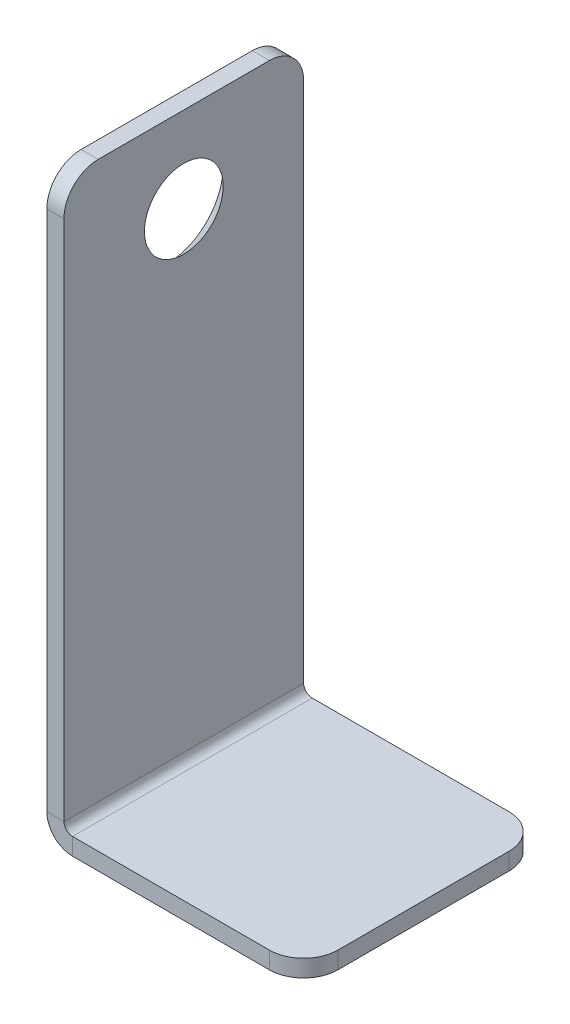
ISO-10303-21;
HEADER;
FILE_DESCRIPTION(('STEP AP214'),'2;1');
FILE_NAME('part.step','',(''),(''),'','','');
FILE_SCHEMA(('AUTOMOTIVE_DESIGN { 1 0 10303 214 1 1 1 1 }'));
ENDSEC;
DATA;
#1=APPLICATION_CONTEXT('core data for automotive mechanical design processes');
#2=APPLICATION_PROTOCOL_DEFINITION('international standard','automotive_design',2000,#1);
#3=PRODUCT_CONTEXT('',#1,'mechanical');
#4=PRODUCT('Part','Part','',(#3));
#5=PRODUCT_RELATED_PRODUCT_CATEGORY('part','',(#4));
#6=PRODUCT_DEFINITION_FORMATION('','',#4);
#7=PRODUCT_DEFINITION_CONTEXT('part definition',#1,'design');
#8=PRODUCT_DEFINITION('design','',#6,#7);
#9=PRODUCT_DEFINITION_SHAPE('','',#8);
#10=(LENGTH_UNIT() NAMED_UNIT(*) SI_UNIT(.MILLI.,.METRE.));
#11=(NAMED_UNIT(*) PLANE_ANGLE_UNIT() SI_UNIT($,.RADIAN.));
#12=(NAMED_UNIT(*) SI_UNIT($,.STERADIAN.) SOLID_ANGLE_UNIT());
#13=UNCERTAINTY_MEASURE_WITH_UNIT(LENGTH_MEASURE(1.E-05),#10,'distance_accuracy_value','');
#14=(GEOMETRIC_REPRESENTATION_CONTEXT(3) GLOBAL_UNCERTAINTY_ASSIGNED_CONTEXT((#13)) GLOBAL_UNIT_ASSIGNED_CONTEXT((#10,
#11,#12)) REPRESENTATION_CONTEXT('',''));
#15=CARTESIAN_POINT('',(0.,0.,0.));
#16=DIRECTION('',(0.,0.,1.));
#17=DIRECTION('',(1.,0.,0.));
#18=AXIS2_PLACEMENT_3D('',#15,#16,#17);
#19=CARTESIAN_POINT('',(0.,1.5,7.));
#20=DIRECTION('',(0.,0.,1.));
#21=DIRECTION('',(1.,0.,0.));
#22=AXIS2_PLACEMENT_3D('',#19,#20,#21);
#23=PLANE('',#22);
#24=DIRECTION('',(1.,0.,0.));
#25=VECTOR('',#24,1.);
#26=CARTESIAN_POINT('',(0.,1.5,7.));
#27=LINE('',#26,#25);
#28=CARTESIAN_POINT('',(0.,1.5,7.));
#29=VERTEX_POINT('',#28);
#30=CARTESIAN_POINT('',(1.,1.5,7.));
#31=VERTEX_POINT('',#30);
#32=EDGE_CURVE('E137',#29,#31,#27,.T.);
#33=ORIENTED_EDGE('',*,*,#32,.F.);
#34=CARTESIAN_POINT('',(1.5,1.5,7.));
#35=DIRECTION('',(0.,0.,-1.));
#36=DIRECTION('',(-1.,0.,0.));
#37=AXIS2_PLACEMENT_3D('',#34,#35,#36);
#38=CIRCLE('',#37,1.5);
#39=CARTESIAN_POINT('',(1.5,0.,7.));
#40=VERTEX_POINT('',#39);
#41=EDGE_CURVE('E135',#29,#40,#38,.F.);
#42=ORIENTED_EDGE('',*,*,#41,.T.);
#43=DIRECTION('',(0.,-1.,0.));
#44=VECTOR('',#43,1.);
#45=CARTESIAN_POINT('',(1.5,1.,7.));
#46=LINE('',#45,#44);
#47=CARTESIAN_POINT('',(1.5,1.,7.));
#48=VERTEX_POINT('',#47);
#49=EDGE_CURVE('E129',#48,#40,#46,.T.);
#50=ORIENTED_EDGE('',*,*,#49,.F.);
#51=CARTESIAN_POINT('',(1.5,1.5,7.));
#52=DIRECTION('',(0.,0.,1.));
#53=DIRECTION('',(1.,0.,0.));
#54=AXIS2_PLACEMENT_3D('',#51,#52,#53);
#55=CIRCLE('',#54,0.5);
#56=EDGE_CURVE('E133',#31,#48,#55,.T.);
#57=ORIENTED_EDGE('',*,*,#56,.F.);
#58=EDGE_LOOP('',(#33,#42,#50,#57));
#59=FACE_BOUND('',#58,.T.);
#60=ADVANCED_FACE('F36',(#59),#23,.T.);
#61=CARTESIAN_POINT('',(1.5,1.,7.));
#62=DIRECTION('',(0.,0.,1.));
#63=DIRECTION('',(1.,0.,0.));
#64=AXIS2_PLACEMENT_3D('',#61,#62,#63);
#65=PLANE('',#64);
#66=DIRECTION('',(0.,-1.,0.));
#67=VECTOR('',#66,1.);
#68=CARTESIAN_POINT('',(1.,34.,7.));
#69=LINE('',#68,#67);
#70=CARTESIAN_POINT('',(1.,32.,7.));
#71=VERTEX_POINT('',#70);
#72=EDGE_CURVE('E158',#71,#31,#69,.T.);
#73=ORIENTED_EDGE('',*,*,#72,.F.);
#74=DIRECTION('',(1.,0.,0.));
#75=VECTOR('',#74,1.);
#76=CARTESIAN_POINT('',(1.5,32.,7.));
#77=LINE('',#76,#75);
#78=CARTESIAN_POINT('',(0.,32.,7.));
#79=VERTEX_POINT('',#78);
#80=EDGE_CURVE('E212',#71,#79,#77,.F.);
#81=ORIENTED_EDGE('',*,*,#80,.T.);
#82=DIRECTION('',(0.,-1.,0.));
#83=VECTOR('',#82,1.);
#84=CARTESIAN_POINT('',(0.,34.,7.));
#85=LINE('',#84,#83);
#86=EDGE_CURVE('E160',#79,#29,#85,.T.);
#87=ORIENTED_EDGE('',*,*,#86,.T.);
#88=ORIENTED_EDGE('',*,*,#32,.T.);
#89=EDGE_LOOP('',(#73,#81,#87,#88));
#90=FACE_BOUND('',#89,.T.);
#91=ADVANCED_FACE('F295',(#90),#65,.T.);
#92=CARTESIAN_POINT('',(1.5,0.,-7.));
#93=DIRECTION('',(0.,0.,-1.));
#94=DIRECTION('',(-1.,0.,0.));
#95=AXIS2_PLACEMENT_3D('',#92,#93,#94);
#96=PLANE('',#95);
#97=DIRECTION('',(0.,1.,0.));
#98=VECTOR('',#97,1.);
#99=CARTESIAN_POINT('',(1.5,0.,-7.));
#100=LINE('',#99,#98);
#101=CARTESIAN_POINT('',(1.5,0.,-7.));
#102=VERTEX_POINT('',#101);
#103=CARTESIAN_POINT('',(1.5,1.,-7.));
#104=VERTEX_POINT('',#103);
#105=EDGE_CURVE('E138',#102,#104,#100,.T.);
#106=ORIENTED_EDGE('',*,*,#105,.F.);
#107=CARTESIAN_POINT('',(1.5,1.5,-7.));
#108=DIRECTION('',(0.,0.,-1.));
#109=DIRECTION('',(-1.,0.,0.));
#110=AXIS2_PLACEMENT_3D('',#107,#108,#109);
#111=CIRCLE('',#110,1.5);
#112=CARTESIAN_POINT('',(0.,1.5,-7.));
#113=VERTEX_POINT('',#112);
#114=EDGE_CURVE('E178',#113,#102,#111,.F.);
#115=ORIENTED_EDGE('',*,*,#114,.F.);
#116=DIRECTION('',(-1.,0.,0.));
#117=VECTOR('',#116,1.);
#118=CARTESIAN_POINT('',(1.,1.5,-7.));
#119=LINE('',#118,#117);
#120=CARTESIAN_POINT('',(1.,1.5,-7.));
#121=VERTEX_POINT('',#120);
#122=EDGE_CURVE('E197',#121,#113,#119,.T.);
#123=ORIENTED_EDGE('',*,*,#122,.F.);
#124=CARTESIAN_POINT('',(1.5,1.5,-7.));
#125=DIRECTION('',(0.,0.,1.));
#126=DIRECTION('',(1.,0.,0.));
#127=AXIS2_PLACEMENT_3D('',#124,#125,#126);
#128=CIRCLE('',#127,0.5);
#129=EDGE_CURVE('E172',#121,#104,#128,.T.);
#130=ORIENTED_EDGE('',*,*,#129,.T.);
#131=EDGE_LOOP('',(#106,#115,#123,#130));
#132=FACE_BOUND('',#131,.T.);
#133=ADVANCED_FACE('F284',(#132),#96,.T.);
#134=CARTESIAN_POINT('',(1.,1.5,-7.));
#135=DIRECTION('',(0.,0.,-1.));
#136=DIRECTION('',(-1.,0.,0.));
#137=AXIS2_PLACEMENT_3D('',#134,#135,#136);
#138=PLANE('',#137);
#139=DIRECTION('',(1.,0.,0.));
#140=VECTOR('',#139,1.);
#141=CARTESIAN_POINT('',(0.,1.,-7.));
#142=LINE('',#141,#140);
#143=CARTESIAN_POINT('',(13.,1.,-7.));
#144=VERTEX_POINT('',#143);
#145=EDGE_CURVE('E145',#104,#144,#142,.T.);
#146=ORIENTED_EDGE('',*,*,#145,.T.);
#147=DIRECTION('',(0.,-1.,0.));
#148=VECTOR('',#147,1.);
#149=CARTESIAN_POINT('',(13.,1.5,-7.));
#150=LINE('',#149,#148);
#151=CARTESIAN_POINT('',(13.,0.,-7.));
#152=VERTEX_POINT('',#151);
#153=EDGE_CURVE('E11',#144,#152,#150,.T.);
#154=ORIENTED_EDGE('',*,*,#153,.T.);
#155=DIRECTION('',(1.,0.,0.));
#156=VECTOR('',#155,1.);
#157=CARTESIAN_POINT('',(0.,0.,-7.));
#158=LINE('',#157,#156);
#159=EDGE_CURVE('E167',#102,#152,#158,.T.);
#160=ORIENTED_EDGE('',*,*,#159,.F.);
#161=ORIENTED_EDGE('',*,*,#105,.T.);
#162=EDGE_LOOP('',(#146,#154,#160,#161));
#163=FACE_BOUND('',#162,.T.);
#164=ADVANCED_FACE('F287',(#163),#138,.T.);
#165=CARTESIAN_POINT('',(0.,0.,7.));
#166=DIRECTION('',(0.,1.,0.));
#167=DIRECTION('',(0.,0.,1.));
#168=AXIS2_PLACEMENT_3D('',#165,#166,#167);
#169=PLANE('',#168);
#170=DIRECTION('',(0.,0.,-1.));
#171=VECTOR('',#170,1.);
#172=CARTESIAN_POINT('',(15.,0.,7.));
#173=LINE('',#172,#171);
#174=CARTESIAN_POINT('',(15.,0.,5.));
#175=VERTEX_POINT('',#174);
#176=CARTESIAN_POINT('',(15.,0.,-5.));
#177=VERTEX_POINT('',#176);
#178=EDGE_CURVE('E194',#175,#177,#173,.T.);
#179=ORIENTED_EDGE('',*,*,#178,.F.);
#180=CARTESIAN_POINT('',(13.,0.,5.));
#181=DIRECTION('',(0.,1.,0.));
#182=DIRECTION('',(0.,0.,1.));
#183=AXIS2_PLACEMENT_3D('',#180,#181,#182);
#184=CIRCLE('',#183,2.);
#185=CARTESIAN_POINT('',(13.,0.,7.));
#186=VERTEX_POINT('',#185);
#187=EDGE_CURVE('E228',#175,#186,#184,.F.);
#188=ORIENTED_EDGE('',*,*,#187,.T.);
#189=DIRECTION('',(1.,0.,0.));
#190=VECTOR('',#189,1.);
#191=CARTESIAN_POINT('',(0.,0.,7.));
#192=LINE('',#191,#190);
#193=EDGE_CURVE('E153',#40,#186,#192,.T.);
#194=ORIENTED_EDGE('',*,*,#193,.F.);
#195=DIRECTION('',(0.,0.,-1.));
#196=VECTOR('',#195,1.);
#197=CARTESIAN_POINT('',(1.5,0.,7.));
#198=LINE('',#197,#196);
#199=EDGE_CURVE('E166',#40,#102,#198,.T.);
#200=ORIENTED_EDGE('',*,*,#199,.T.);
#201=ORIENTED_EDGE('',*,*,#159,.T.);
#202=CARTESIAN_POINT('',(13.,0.,-5.));
#203=DIRECTION('',(0.,1.,0.));
#204=DIRECTION('',(0.,0.,1.));
#205=AXIS2_PLACEMENT_3D('',#202,#203,#204);
#206=CIRCLE('',#205,2.);
#207=EDGE_CURVE('E226',#152,#177,#206,.F.);
#208=ORIENTED_EDGE('',*,*,#207,.T.);
#209=EDGE_LOOP('',(#179,#188,#194,#200,#201,#208));
#210=FACE_BOUND('',#209,.T.);
#211=ADVANCED_FACE('F241',(#210),#169,.F.);
#212=CARTESIAN_POINT('',(15.,1.,7.));
#213=DIRECTION('',(1.,0.,0.));
#214=DIRECTION('',(0.,0.,-1.));
#215=AXIS2_PLACEMENT_3D('',#212,#213,#214);
#216=PLANE('',#215);
#217=DIRECTION('',(0.,0.,-1.));
#218=VECTOR('',#217,1.);
#219=CARTESIAN_POINT('',(15.,1.,7.));
#220=LINE('',#219,#218);
#221=CARTESIAN_POINT('',(15.,1.,5.));
#222=VERTEX_POINT('',#221);
#223=CARTESIAN_POINT('',(15.,1.,-5.));
#224=VERTEX_POINT('',#223);
#225=EDGE_CURVE('E149',#222,#224,#220,.T.);
#226=ORIENTED_EDGE('',*,*,#225,.F.);
#227=DIRECTION('',(0.,-1.,0.));
#228=VECTOR('',#227,1.);
#229=CARTESIAN_POINT('',(15.,1.,5.));
#230=LINE('',#229,#228);
#231=EDGE_CURVE('E223',#222,#175,#230,.T.);
#232=ORIENTED_EDGE('',*,*,#231,.T.);
#233=ORIENTED_EDGE('',*,*,#178,.T.);
#234=DIRECTION('',(0.,-1.,0.));
#235=VECTOR('',#234,1.);
#236=CARTESIAN_POINT('',(15.,1.,-5.));
#237=LINE('',#236,#235);
#238=EDGE_CURVE('E221',#177,#224,#237,.F.);
#239=ORIENTED_EDGE('',*,*,#238,.T.);
#240=EDGE_LOOP('',(#226,#232,#233,#239));
#241=FACE_BOUND('',#240,.T.);
#242=ADVANCED_FACE('F235',(#241),#216,.T.);
#243=CARTESIAN_POINT('',(0.,1.,7.));
#244=DIRECTION('',(0.,1.,0.));
#245=DIRECTION('',(0.,0.,1.));
#246=AXIS2_PLACEMENT_3D('',#243,#244,#245);
#247=PLANE('',#246);
#248=DIRECTION('',(1.,0.,0.));
#249=VECTOR('',#248,1.);
#250=CARTESIAN_POINT('',(0.,1.,7.));
#251=LINE('',#250,#249);
#252=CARTESIAN_POINT('',(13.,1.,7.));
#253=VERTEX_POINT('',#252);
#254=EDGE_CURVE('E143',#48,#253,#251,.T.);
#255=ORIENTED_EDGE('',*,*,#254,.T.);
#256=CARTESIAN_POINT('',(13.,1.,5.));
#257=DIRECTION('',(0.,1.,0.));
#258=DIRECTION('',(0.,0.,1.));
#259=AXIS2_PLACEMENT_3D('',#256,#257,#258);
#260=CIRCLE('',#259,2.);
#261=EDGE_CURVE('E44',#253,#222,#260,.T.);
#262=ORIENTED_EDGE('',*,*,#261,.T.);
#263=ORIENTED_EDGE('',*,*,#225,.T.);
#264=CARTESIAN_POINT('',(13.,1.,-5.));
#265=DIRECTION('',(0.,1.,0.));
#266=DIRECTION('',(0.,0.,1.));
#267=AXIS2_PLACEMENT_3D('',#264,#265,#266);
#268=CIRCLE('',#267,2.);
#269=EDGE_CURVE('E51',#224,#144,#268,.T.);
#270=ORIENTED_EDGE('',*,*,#269,.T.);
#271=ORIENTED_EDGE('',*,*,#145,.F.);
#272=DIRECTION('',(0.,0.,-1.));
#273=VECTOR('',#272,1.);
#274=CARTESIAN_POINT('',(1.5,1.,7.));
#275=LINE('',#274,#273);
#276=EDGE_CURVE('E141',#48,#104,#275,.T.);
#277=ORIENTED_EDGE('',*,*,#276,.F.);
#278=EDGE_LOOP('',(#255,#262,#263,#270,#271,#277));
#279=FACE_BOUND('',#278,.T.);
#280=ADVANCED_FACE('F142',(#279),#247,.T.);
#281=CARTESIAN_POINT('',(1.5,1.5,7.));
#282=DIRECTION('',(0.,0.,-1.));
#283=DIRECTION('',(-1.,0.,0.));
#284=AXIS2_PLACEMENT_3D('',#281,#282,#283);
#285=CYLINDRICAL_SURFACE('',#284,0.5);
#286=ORIENTED_EDGE('',*,*,#129,.F.);
#287=DIRECTION('',(0.,0.,-1.));
#288=VECTOR('',#287,1.);
#289=CARTESIAN_POINT('',(1.,1.5,7.));
#290=LINE('',#289,#288);
#291=EDGE_CURVE('E150',#31,#121,#290,.T.);
#292=ORIENTED_EDGE('',*,*,#291,.F.);
#293=ORIENTED_EDGE('',*,*,#56,.T.);
#294=ORIENTED_EDGE('',*,*,#276,.T.);
#295=EDGE_LOOP('',(#286,#292,#293,#294));
#296=FACE_BOUND('',#295,.T.);
#297=ADVANCED_FACE('F156',(#296),#285,.F.);
#298=CARTESIAN_POINT('',(1.,34.,7.));
#299=DIRECTION('',(1.,0.,0.));
#300=DIRECTION('',(0.,1.,0.));
#301=AXIS2_PLACEMENT_3D('',#298,#299,#300);
#302=PLANE('',#301);
#303=CARTESIAN_POINT('',(1.,29.,0.));
#304=DIRECTION('',(1.,0.,0.));
#305=DIRECTION('',(0.,1.,0.));
#306=AXIS2_PLACEMENT_3D('',#303,#304,#305);
#307=CIRCLE('',#306,2.3);
#308=CARTESIAN_POINT('',(1.,31.3,0.));
#309=VERTEX_POINT('',#308);
#310=EDGE_CURVE('E170',#309,#309,#307,.T.);
#311=ORIENTED_EDGE('',*,*,#310,.F.);
#312=EDGE_LOOP('',(#311));
#313=FACE_BOUND('',#312,.T.);
#314=DIRECTION('',(0.,0.,-1.));
#315=VECTOR('',#314,1.);
#316=CARTESIAN_POINT('',(1.,34.,7.));
#317=LINE('',#316,#315);
#318=CARTESIAN_POINT('',(1.,34.,5.));
#319=VERTEX_POINT('',#318);
#320=CARTESIAN_POINT('',(1.,34.,-5.));
#321=VERTEX_POINT('',#320);
#322=EDGE_CURVE('E189',#319,#321,#317,.T.);
#323=ORIENTED_EDGE('',*,*,#322,.F.);
#324=CARTESIAN_POINT('',(1.,32.,5.));
#325=DIRECTION('',(1.,0.,0.));
#326=DIRECTION('',(0.,1.,0.));
#327=AXIS2_PLACEMENT_3D('',#324,#325,#326);
#328=CIRCLE('',#327,2.);
#329=EDGE_CURVE('E210',#319,#71,#328,.T.);
#330=ORIENTED_EDGE('',*,*,#329,.T.);
#331=ORIENTED_EDGE('',*,*,#72,.T.);
#332=ORIENTED_EDGE('',*,*,#291,.T.);
#333=DIRECTION('',(0.,-1.,0.));
#334=VECTOR('',#333,1.);
#335=CARTESIAN_POINT('',(1.,34.,-7.));
#336=LINE('',#335,#334);
#337=CARTESIAN_POINT('',(1.,32.,-7.));
#338=VERTEX_POINT('',#337);
#339=EDGE_CURVE('E174',#338,#121,#336,.T.);
#340=ORIENTED_EDGE('',*,*,#339,.F.);
#341=CARTESIAN_POINT('',(1.,32.,-5.));
#342=DIRECTION('',(1.,0.,0.));
#343=DIRECTION('',(0.,1.,0.));
#344=AXIS2_PLACEMENT_3D('',#341,#342,#343);
#345=CIRCLE('',#344,2.);
#346=EDGE_CURVE('E208',#338,#321,#345,.T.);
#347=ORIENTED_EDGE('',*,*,#346,.T.);
#348=EDGE_LOOP('',(#323,#330,#331,#332,#340,#347));
#349=FACE_BOUND('',#348,.T.);
#350=ADVANCED_FACE('F270',(#313,#349),#302,.T.);
#351=CARTESIAN_POINT('',(0.,34.,7.));
#352=DIRECTION('',(0.,1.,0.));
#353=DIRECTION('',(0.,0.,1.));
#354=AXIS2_PLACEMENT_3D('',#351,#352,#353);
#355=PLANE('',#354);
#356=DIRECTION('',(0.,0.,-1.));
#357=VECTOR('',#356,1.);
#358=CARTESIAN_POINT('',(0.,34.,7.));
#359=LINE('',#358,#357);
#360=CARTESIAN_POINT('',(0.,34.,5.));
#361=VERTEX_POINT('',#360);
#362=CARTESIAN_POINT('',(0.,34.,-5.));
#363=VERTEX_POINT('',#362);
#364=EDGE_CURVE('E186',#361,#363,#359,.T.);
#365=ORIENTED_EDGE('',*,*,#364,.F.);
#366=DIRECTION('',(1.,0.,0.));
#367=VECTOR('',#366,1.);
#368=CARTESIAN_POINT('',(0.,34.,5.));
#369=LINE('',#368,#367);
#370=EDGE_CURVE('E205',#361,#319,#369,.T.);
#371=ORIENTED_EDGE('',*,*,#370,.T.);
#372=ORIENTED_EDGE('',*,*,#322,.T.);
#373=DIRECTION('',(1.,0.,0.));
#374=VECTOR('',#373,1.);
#375=CARTESIAN_POINT('',(0.,34.,-5.));
#376=LINE('',#375,#374);
#377=EDGE_CURVE('E203',#321,#363,#376,.F.);
#378=ORIENTED_EDGE('',*,*,#377,.T.);
#379=EDGE_LOOP('',(#365,#371,#372,#378));
#380=FACE_BOUND('',#379,.T.);
#381=ADVANCED_FACE('F255',(#380),#355,.T.);
#382=CARTESIAN_POINT('',(0.,34.,7.));
#383=DIRECTION('',(1.,0.,0.));
#384=DIRECTION('',(0.,1.,0.));
#385=AXIS2_PLACEMENT_3D('',#382,#383,#384);
#386=PLANE('',#385);
#387=CARTESIAN_POINT('',(0.,29.,0.));
#388=DIRECTION('',(-1.,0.,0.));
#389=DIRECTION('',(0.,0.,1.));
#390=AXIS2_PLACEMENT_3D('',#387,#388,#389);
#391=CIRCLE('',#390,3.3);
#392=CARTESIAN_POINT('',(0.,29.,3.30000000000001));
#393=VERTEX_POINT('',#392);
#394=EDGE_CURVE('E245',#393,#393,#391,.T.);
#395=ORIENTED_EDGE('',*,*,#394,.F.);
#396=EDGE_LOOP('',(#395));
#397=FACE_BOUND('',#396,.T.);
#398=ORIENTED_EDGE('',*,*,#86,.F.);
#399=CARTESIAN_POINT('',(0.,32.,5.));
#400=DIRECTION('',(1.,0.,0.));
#401=DIRECTION('',(0.,1.,0.));
#402=AXIS2_PLACEMENT_3D('',#399,#400,#401);
#403=CIRCLE('',#402,2.);
#404=EDGE_CURVE('E216',#79,#361,#403,.F.);
#405=ORIENTED_EDGE('',*,*,#404,.T.);
#406=ORIENTED_EDGE('',*,*,#364,.T.);
#407=CARTESIAN_POINT('',(0.,32.,-5.));
#408=DIRECTION('',(1.,0.,0.));
#409=DIRECTION('',(0.,1.,0.));
#410=AXIS2_PLACEMENT_3D('',#407,#408,#409);
#411=CIRCLE('',#410,2.);
#412=CARTESIAN_POINT('',(0.,32.,-7.));
#413=VERTEX_POINT('',#412);
#414=EDGE_CURVE('E214',#363,#413,#411,.F.);
#415=ORIENTED_EDGE('',*,*,#414,.T.);
#416=DIRECTION('',(0.,-1.,0.));
#417=VECTOR('',#416,1.);
#418=CARTESIAN_POINT('',(0.,34.,-7.));
#419=LINE('',#418,#417);
#420=EDGE_CURVE('E176',#413,#113,#419,.T.);
#421=ORIENTED_EDGE('',*,*,#420,.T.);
#422=DIRECTION('',(0.,0.,-1.));
#423=VECTOR('',#422,1.);
#424=CARTESIAN_POINT('',(0.,1.5,7.));
#425=LINE('',#424,#423);
#426=EDGE_CURVE('E183',#29,#113,#425,.T.);
#427=ORIENTED_EDGE('',*,*,#426,.F.);
#428=EDGE_LOOP('',(#398,#405,#406,#415,#421,#427));
#429=FACE_BOUND('',#428,.T.);
#430=ADVANCED_FACE('F251',(#397,#429),#386,.F.);
#431=CARTESIAN_POINT('',(1.5,1.5,7.));
#432=DIRECTION('',(0.,0.,-1.));
#433=DIRECTION('',(-1.,0.,0.));
#434=AXIS2_PLACEMENT_3D('',#431,#432,#433);
#435=CYLINDRICAL_SURFACE('',#434,1.5);
#436=ORIENTED_EDGE('',*,*,#114,.T.);
#437=ORIENTED_EDGE('',*,*,#199,.F.);
#438=ORIENTED_EDGE('',*,*,#41,.F.);
#439=ORIENTED_EDGE('',*,*,#426,.T.);
#440=EDGE_LOOP('',(#436,#437,#438,#439));
#441=FACE_BOUND('',#440,.T.);
#442=ADVANCED_FACE('F254',(#441),#435,.T.);
#443=CARTESIAN_POINT('',(1.5,1.5,7.));
#444=DIRECTION('',(0.,0.,1.));
#445=DIRECTION('',(1.,0.,0.));
#446=AXIS2_PLACEMENT_3D('',#443,#444,#445);
#447=PLANE('',#446);
#448=ORIENTED_EDGE('',*,*,#193,.T.);
#449=DIRECTION('',(0.,-1.,0.));
#450=VECTOR('',#449,1.);
#451=CARTESIAN_POINT('',(13.,1.5,7.));
#452=LINE('',#451,#450);
#453=EDGE_CURVE('E59',#186,#253,#452,.F.);
#454=ORIENTED_EDGE('',*,*,#453,.T.);
#455=ORIENTED_EDGE('',*,*,#254,.F.);
#456=ORIENTED_EDGE('',*,*,#49,.T.);
#457=EDGE_LOOP('',(#448,#454,#455,#456));
#458=FACE_BOUND('',#457,.T.);
#459=ADVANCED_FACE('F152',(#458),#447,.T.);
#460=CARTESIAN_POINT('',(1.5,1.5,-7.));
#461=DIRECTION('',(0.,0.,1.));
#462=DIRECTION('',(1.,0.,0.));
#463=AXIS2_PLACEMENT_3D('',#460,#461,#462);
#464=PLANE('',#463);
#465=ORIENTED_EDGE('',*,*,#420,.F.);
#466=DIRECTION('',(1.,0.,0.));
#467=VECTOR('',#466,1.);
#468=CARTESIAN_POINT('',(1.,32.,-7.));
#469=LINE('',#468,#467);
#470=EDGE_CURVE('E218',#413,#338,#469,.T.);
#471=ORIENTED_EDGE('',*,*,#470,.T.);
#472=ORIENTED_EDGE('',*,*,#339,.T.);
#473=ORIENTED_EDGE('',*,*,#122,.T.);
#474=EDGE_LOOP('',(#465,#471,#472,#473));
#475=FACE_BOUND('',#474,.T.);
#476=ADVANCED_FACE('F279',(#475),#464,.F.);
#477=CARTESIAN_POINT('',(0.,29.,0.));
#478=DIRECTION('',(-1.,0.,0.));
#479=DIRECTION('',(0.,0.,1.));
#480=AXIS2_PLACEMENT_3D('',#477,#478,#479);
#481=CONICAL_SURFACE('',#480,3.3,0.785398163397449);
#482=ORIENTED_EDGE('',*,*,#310,.T.);
#483=EDGE_LOOP('',(#482));
#484=FACE_BOUND('',#483,.T.);
#485=ORIENTED_EDGE('',*,*,#394,.T.);
#486=EDGE_LOOP('',(#485));
#487=FACE_BOUND('',#486,.T.);
#488=ADVANCED_FACE('F249',(#484,#487),#481,.F.);
#489=CARTESIAN_POINT('',(0.,32.,5.));
#490=DIRECTION('',(1.,0.,0.));
#491=DIRECTION('',(0.,0.,-1.));
#492=AXIS2_PLACEMENT_3D('',#489,#490,#491);
#493=CYLINDRICAL_SURFACE('',#492,2.);
#494=ORIENTED_EDGE('',*,*,#404,.F.);
#495=ORIENTED_EDGE('',*,*,#80,.F.);
#496=ORIENTED_EDGE('',*,*,#329,.F.);
#497=ORIENTED_EDGE('',*,*,#370,.F.);
#498=EDGE_LOOP('',(#494,#495,#496,#497));
#499=FACE_BOUND('',#498,.T.);
#500=ADVANCED_FACE('F265',(#499),#493,.T.);
#501=CARTESIAN_POINT('',(1.5,32.,-5.));
#502=DIRECTION('',(-1.,0.,0.));
#503=DIRECTION('',(0.,0.,1.));
#504=AXIS2_PLACEMENT_3D('',#501,#502,#503);
#505=CYLINDRICAL_SURFACE('',#504,2.);
#506=ORIENTED_EDGE('',*,*,#414,.F.);
#507=ORIENTED_EDGE('',*,*,#377,.F.);
#508=ORIENTED_EDGE('',*,*,#346,.F.);
#509=ORIENTED_EDGE('',*,*,#470,.F.);
#510=EDGE_LOOP('',(#506,#507,#508,#509));
#511=FACE_BOUND('',#510,.T.);
#512=ADVANCED_FACE('F276',(#511),#505,.T.);
#513=CARTESIAN_POINT('',(13.,1.,5.));
#514=DIRECTION('',(0.,-1.,0.));
#515=DIRECTION('',(0.,0.,-1.));
#516=AXIS2_PLACEMENT_3D('',#513,#514,#515);
#517=CYLINDRICAL_SURFACE('',#516,2.);
#518=ORIENTED_EDGE('',*,*,#261,.F.);
#519=ORIENTED_EDGE('',*,*,#453,.F.);
#520=ORIENTED_EDGE('',*,*,#187,.F.);
#521=ORIENTED_EDGE('',*,*,#231,.F.);
#522=EDGE_LOOP('',(#518,#519,#520,#521));
#523=FACE_BOUND('',#522,.T.);
#524=ADVANCED_FACE('F238',(#523),#517,.T.);
#525=CARTESIAN_POINT('',(13.,1.5,-5.));
#526=DIRECTION('',(0.,-1.,0.));
#527=DIRECTION('',(0.,0.,-1.));
#528=AXIS2_PLACEMENT_3D('',#525,#526,#527);
#529=CYLINDRICAL_SURFACE('',#528,2.);
#530=ORIENTED_EDGE('',*,*,#269,.F.);
#531=ORIENTED_EDGE('',*,*,#238,.F.);
#532=ORIENTED_EDGE('',*,*,#207,.F.);
#533=ORIENTED_EDGE('',*,*,#153,.F.);
#534=EDGE_LOOP('',(#530,#531,#532,#533));
#535=FACE_BOUND('',#534,.T.);
#536=ADVANCED_FACE('F38',(#535),#529,.T.);
#537=CLOSED_SHELL('',(#60,#91,#133,#164,#211,#242,#280,#297,#350,#381,#430,#442,#459,#476,#488,
#500,#512,#524,#536));
#538=MANIFOLD_SOLID_BREP('B2',#537);
#539=ADVANCED_BREP_SHAPE_REPRESENTATION('',(#18,#538),#14);
#540=SHAPE_DEFINITION_REPRESENTATION(#9,#539);
ENDSEC;
END-ISO-10303-21;
